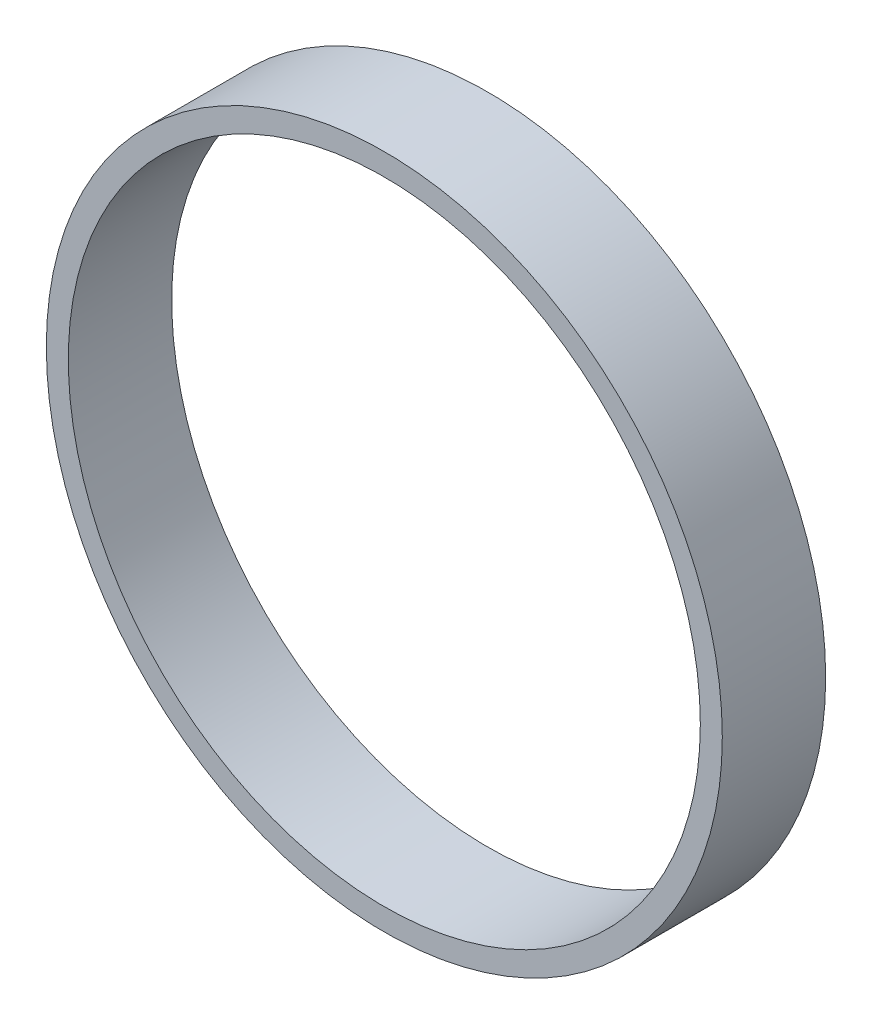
ISO-10303-21;
HEADER;
FILE_DESCRIPTION(('STEP AP214'),'2;1');
FILE_NAME('part.step','',(''),(''),'','','');
FILE_SCHEMA(('AUTOMOTIVE_DESIGN { 1 0 10303 214 1 1 1 1 }'));
ENDSEC;
DATA;
#1=APPLICATION_CONTEXT('core data for automotive mechanical design processes');
#2=APPLICATION_PROTOCOL_DEFINITION('international standard','automotive_design',2000,#1);
#3=PRODUCT_CONTEXT('',#1,'mechanical');
#4=PRODUCT('Part','Part','',(#3));
#5=PRODUCT_RELATED_PRODUCT_CATEGORY('part','',(#4));
#6=PRODUCT_DEFINITION_FORMATION('','',#4);
#7=PRODUCT_DEFINITION_CONTEXT('part definition',#1,'design');
#8=PRODUCT_DEFINITION('design','',#6,#7);
#9=PRODUCT_DEFINITION_SHAPE('','',#8);
#10=(LENGTH_UNIT() NAMED_UNIT(*) SI_UNIT(.MILLI.,.METRE.));
#11=(NAMED_UNIT(*) PLANE_ANGLE_UNIT() SI_UNIT($,.RADIAN.));
#12=(NAMED_UNIT(*) SI_UNIT($,.STERADIAN.) SOLID_ANGLE_UNIT());
#13=UNCERTAINTY_MEASURE_WITH_UNIT(LENGTH_MEASURE(1.E-05),#10,'distance_accuracy_value','');
#14=(GEOMETRIC_REPRESENTATION_CONTEXT(3) GLOBAL_UNCERTAINTY_ASSIGNED_CONTEXT((#13)) GLOBAL_UNIT_ASSIGNED_CONTEXT((#10,
#11,#12)) REPRESENTATION_CONTEXT('',''));
#15=CARTESIAN_POINT('',(0.,0.,0.));
#16=DIRECTION('',(0.,0.,1.));
#17=DIRECTION('',(1.,0.,0.));
#18=AXIS2_PLACEMENT_3D('',#15,#16,#17);
#19=CARTESIAN_POINT('',(0.,0.,12.7));
#20=DIRECTION('',(0.,0.,1.));
#21=DIRECTION('',(1.,0.,0.));
#22=AXIS2_PLACEMENT_3D('',#19,#20,#21);
#23=PLANE('',#22);
#24=CARTESIAN_POINT('',(0.,0.,12.7));
#25=DIRECTION('',(0.,0.,1.));
#26=DIRECTION('',(1.,0.,0.));
#27=AXIS2_PLACEMENT_3D('',#24,#25,#26);
#28=CIRCLE('',#27,83.05);
#29=CARTESIAN_POINT('',(83.05,0.,12.7));
#30=VERTEX_POINT('',#29);
#31=EDGE_CURVE('E10',#30,#30,#28,.T.);
#32=ORIENTED_EDGE('',*,*,#31,.T.);
#33=EDGE_LOOP('',(#32));
#34=FACE_BOUND('',#33,.T.);
#35=CARTESIAN_POINT('',(0.,0.,12.7));
#36=DIRECTION('',(0.,0.,1.));
#37=DIRECTION('',(1.,0.,0.));
#38=AXIS2_PLACEMENT_3D('',#35,#36,#37);
#39=CIRCLE('',#38,77.65);
#40=CARTESIAN_POINT('',(77.65,0.,12.7));
#41=VERTEX_POINT('',#40);
#42=EDGE_CURVE('E42',#41,#41,#39,.T.);
#43=ORIENTED_EDGE('',*,*,#42,.F.);
#44=EDGE_LOOP('',(#43));
#45=FACE_BOUND('',#44,.T.);
#46=ADVANCED_FACE('F31',(#34,#45),#23,.T.);
#47=CARTESIAN_POINT('',(0.,0.,-12.7));
#48=DIRECTION('',(0.,0.,1.));
#49=DIRECTION('',(1.,0.,0.));
#50=AXIS2_PLACEMENT_3D('',#47,#48,#49);
#51=PLANE('',#50);
#52=CARTESIAN_POINT('',(0.,0.,-12.7));
#53=DIRECTION('',(0.,0.,1.));
#54=DIRECTION('',(1.,0.,0.));
#55=AXIS2_PLACEMENT_3D('',#52,#53,#54);
#56=CIRCLE('',#55,83.05);
#57=CARTESIAN_POINT('',(83.05,0.,-12.7));
#58=VERTEX_POINT('',#57);
#59=EDGE_CURVE('E35',#58,#58,#56,.T.);
#60=ORIENTED_EDGE('',*,*,#59,.F.);
#61=EDGE_LOOP('',(#60));
#62=FACE_BOUND('',#61,.T.);
#63=CARTESIAN_POINT('',(0.,0.,-12.7));
#64=DIRECTION('',(0.,0.,1.));
#65=DIRECTION('',(1.,0.,0.));
#66=AXIS2_PLACEMENT_3D('',#63,#64,#65);
#67=CIRCLE('',#66,77.65);
#68=CARTESIAN_POINT('',(77.65,0.,-12.7));
#69=VERTEX_POINT('',#68);
#70=EDGE_CURVE('E44',#69,#69,#67,.T.);
#71=ORIENTED_EDGE('',*,*,#70,.T.);
#72=EDGE_LOOP('',(#71));
#73=FACE_BOUND('',#72,.T.);
#74=ADVANCED_FACE('F54',(#62,#73),#51,.F.);
#75=CARTESIAN_POINT('',(0.,0.,12.7));
#76=DIRECTION('',(0.,0.,-1.));
#77=DIRECTION('',(-1.,0.,0.));
#78=AXIS2_PLACEMENT_3D('',#75,#76,#77);
#79=CYLINDRICAL_SURFACE('',#78,83.05);
#80=ORIENTED_EDGE('',*,*,#31,.F.);
#81=EDGE_LOOP('',(#80));
#82=FACE_BOUND('',#81,.T.);
#83=ORIENTED_EDGE('',*,*,#59,.T.);
#84=EDGE_LOOP('',(#83));
#85=FACE_BOUND('',#84,.T.);
#86=ADVANCED_FACE('F33',(#82,#85),#79,.T.);
#87=CARTESIAN_POINT('',(0.,0.,12.7));
#88=DIRECTION('',(0.,0.,-1.));
#89=DIRECTION('',(-1.,0.,0.));
#90=AXIS2_PLACEMENT_3D('',#87,#88,#89);
#91=CYLINDRICAL_SURFACE('',#90,77.65);
#92=ORIENTED_EDGE('',*,*,#42,.T.);
#93=EDGE_LOOP('',(#92));
#94=FACE_BOUND('',#93,.T.);
#95=ORIENTED_EDGE('',*,*,#70,.F.);
#96=EDGE_LOOP('',(#95));
#97=FACE_BOUND('',#96,.T.);
#98=ADVANCED_FACE('F50',(#94,#97),#91,.F.);
#99=CLOSED_SHELL('',(#46,#74,#86,#98));
#100=MANIFOLD_SOLID_BREP('B2',#99);
#101=ADVANCED_BREP_SHAPE_REPRESENTATION('',(#18,#100),#14);
#102=SHAPE_DEFINITION_REPRESENTATION(#9,#101);
ENDSEC;
END-ISO-10303-21;
